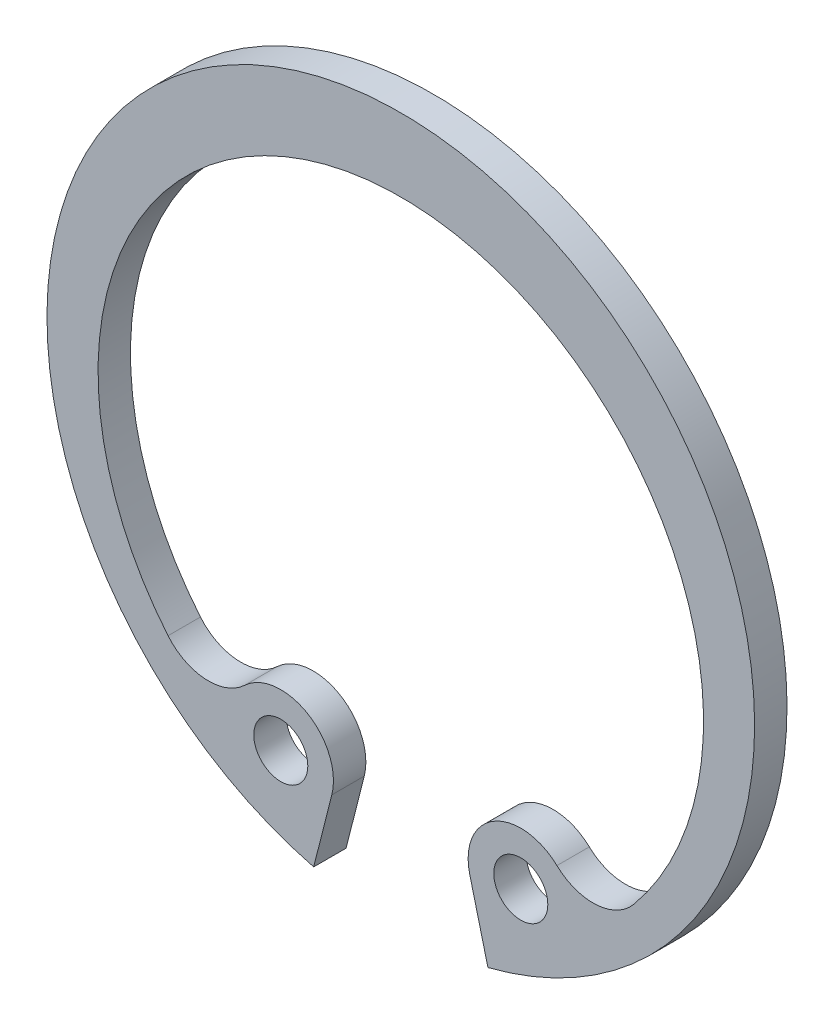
from build123d import *

# Parameters (mm, degrees)
BODYSKE_R  = 1
BODY_DEPTH = 1.2


with BuildPart() as part:
    # BodySke → Body (new body)
    with BuildSketch(Plane.XY):
        with BuildLine():
            Line((3.225876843, -12.69660264), (2.5531758, -10.048944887))
            ThreePointArc((2.5531758, -10.048944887), (3.454230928, -7.88810772), (5.780732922, -8.149844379))
            ThreePointArc((5.780732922, -8.149844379), (7.236249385, -8.67736347), (8.617443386, -7.978001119))
            ThreePointArc((8.617443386, -7.978001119), (0, 10.4), (-8.617443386, -7.978001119))
            ThreePointArc((-8.617443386, -7.978001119), (-7.236249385, -8.67736347), (-5.780732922, -8.149844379))
            ThreePointArc((-5.780732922, -8.149844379), (-3.454230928, -7.88810772), (-2.5531758, -10.048944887))
            Line((-2.5531758, -10.048944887), (-3.225876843, -12.69660264))
            ThreePointArc((-3.225876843, -12.69660264), (0, 13.1), (3.225876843, -12.69660264))
        make_face()
        with Locations((4.443128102, -9.568757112)):
            Circle(BODYSKE_R, mode=Mode.SUBTRACT)
        with Locations((-4.443128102, -9.568757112)):
            Circle(BODYSKE_R, mode=Mode.SUBTRACT)
    extrude(amount=-BODY_DEPTH)


solid = part.part
